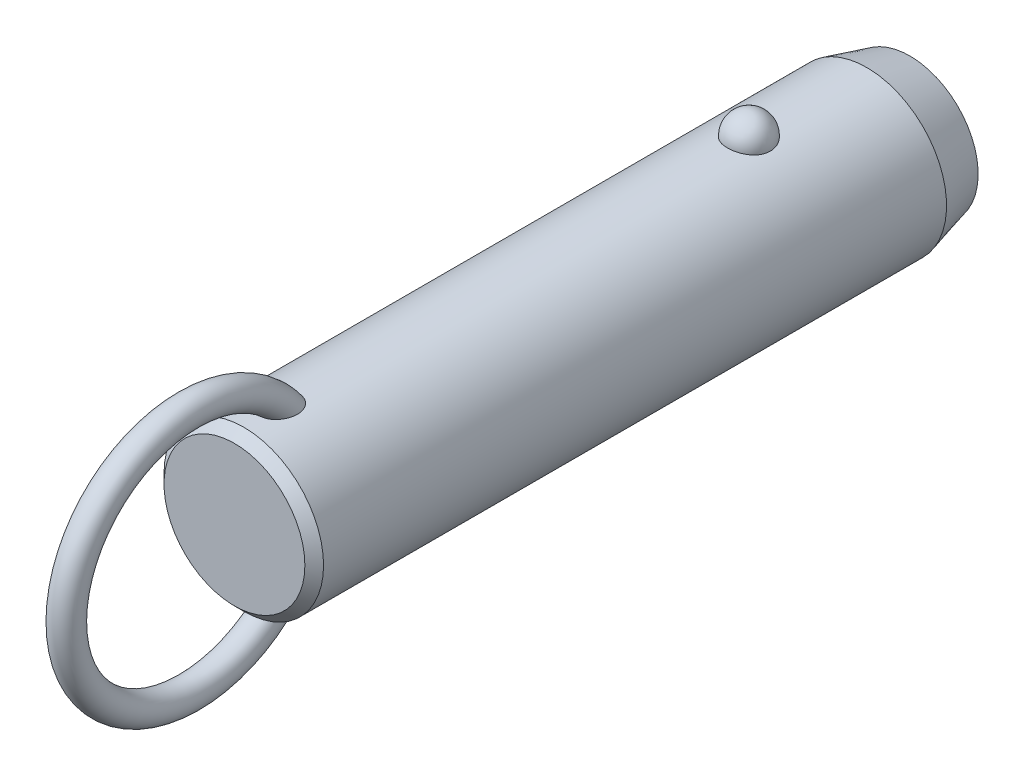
ISO-10303-21;
HEADER;
FILE_DESCRIPTION(('STEP AP214'),'2;1');
FILE_NAME('part.step','',(''),(''),'','','');
FILE_SCHEMA(('AUTOMOTIVE_DESIGN { 1 0 10303 214 1 1 1 1 }'));
ENDSEC;
DATA;
#1=APPLICATION_CONTEXT('core data for automotive mechanical design processes');
#2=APPLICATION_PROTOCOL_DEFINITION('international standard','automotive_design',2000,#1);
#3=PRODUCT_CONTEXT('',#1,'mechanical');
#4=PRODUCT('Part','Part','',(#3));
#5=PRODUCT_RELATED_PRODUCT_CATEGORY('part','',(#4));
#6=PRODUCT_DEFINITION_FORMATION('','',#4);
#7=PRODUCT_DEFINITION_CONTEXT('part definition',#1,'design');
#8=PRODUCT_DEFINITION('design','',#6,#7);
#9=PRODUCT_DEFINITION_SHAPE('','',#8);
#10=(LENGTH_UNIT() NAMED_UNIT(*) SI_UNIT(.MILLI.,.METRE.));
#11=(NAMED_UNIT(*) PLANE_ANGLE_UNIT() SI_UNIT($,.RADIAN.));
#12=(NAMED_UNIT(*) SI_UNIT($,.STERADIAN.) SOLID_ANGLE_UNIT());
#13=UNCERTAINTY_MEASURE_WITH_UNIT(LENGTH_MEASURE(1.E-05),#10,'distance_accuracy_value','');
#14=(GEOMETRIC_REPRESENTATION_CONTEXT(3) GLOBAL_UNCERTAINTY_ASSIGNED_CONTEXT((#13)) GLOBAL_UNIT_ASSIGNED_CONTEXT((#10,
#11,#12)) REPRESENTATION_CONTEXT('',''));
#15=CARTESIAN_POINT('',(0.,0.,0.));
#16=DIRECTION('',(0.,0.,1.));
#17=DIRECTION('',(1.,0.,0.));
#18=AXIS2_PLACEMENT_3D('',#15,#16,#17);
#19=CARTESIAN_POINT('',(0.,0.,55.9));
#20=DIRECTION('',(0.,0.,-1.));
#21=DIRECTION('',(-1.,0.,0.));
#22=AXIS2_PLACEMENT_3D('',#19,#20,#21);
#23=CYLINDRICAL_SURFACE('',#22,11.1);
#24=CARTESIAN_POINT('',(2.9724815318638,10.6945945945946,-3.));
#25=CARTESIAN_POINT('',(2.97247830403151,10.6945972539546,-2.83225059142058));
#26=CARTESIAN_POINT('',(2.95876598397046,10.6984356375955,-2.66445972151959));
#27=CARTESIAN_POINT('',(2.90424529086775,10.7133624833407,-2.33362381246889));
#28=CARTESIAN_POINT('',(2.8634252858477,10.7244540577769,-2.1705808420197));
#29=CARTESIAN_POINT('',(2.75573657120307,10.7526272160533,-1.85396767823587));
#30=CARTESIAN_POINT('',(2.68887937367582,10.7697061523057,-1.70039333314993));
#31=CARTESIAN_POINT('',(2.53079696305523,10.8079438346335,-1.40691598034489));
#32=CARTESIAN_POINT('',(2.43957264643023,10.8291024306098,-1.2670124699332));
#33=CARTESIAN_POINT('',(2.23458150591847,10.8732541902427,-1.00409565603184));
#34=CARTESIAN_POINT('',(2.12071295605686,10.8962553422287,-0.881162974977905));
#35=CARTESIAN_POINT('',(1.87365402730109,10.9414421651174,-0.656352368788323));
#36=CARTESIAN_POINT('',(1.74046358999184,10.9636278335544,-0.554474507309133));
#37=CARTESIAN_POINT('',(1.45872188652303,11.0046495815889,-0.374872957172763));
#38=CARTESIAN_POINT('',(1.31021276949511,11.0234944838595,-0.297085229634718));
#39=CARTESIAN_POINT('',(1.00170030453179,11.0557957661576,-0.167529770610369));
#40=CARTESIAN_POINT('',(0.841698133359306,11.0692526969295,-0.115759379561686));
#41=CARTESIAN_POINT('',(0.517607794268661,11.0890932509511,-0.0403925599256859));
#42=CARTESIAN_POINT('',(0.353633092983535,11.0955916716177,-0.0163383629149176));
#43=CARTESIAN_POINT('',(0.0238420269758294,11.1011989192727,0.0044517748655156));
#44=CARTESIAN_POINT('',(-0.141974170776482,11.1003084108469,0.00119017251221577));
#45=CARTESIAN_POINT('',(-0.468405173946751,11.0912990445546,-0.0323233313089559));
#46=CARTESIAN_POINT('',(-0.629059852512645,11.0832767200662,-0.0622147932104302));
#47=CARTESIAN_POINT('',(-0.942937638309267,11.0609962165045,-0.147645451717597));
#48=CARTESIAN_POINT('',(-1.09616062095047,11.0467379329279,-0.203185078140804));
#49=CARTESIAN_POINT('',(-1.39181061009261,11.0134071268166,-0.3387529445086));
#50=CARTESIAN_POINT('',(-1.53417383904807,10.9943086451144,-0.418913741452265));
#51=CARTESIAN_POINT('',(-1.80342160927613,10.9533667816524,-0.60144882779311));
#52=CARTESIAN_POINT('',(-1.9303046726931,10.9315231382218,-0.703825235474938));
#53=CARTESIAN_POINT('',(-2.16747598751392,10.887005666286,-0.930091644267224));
#54=CARTESIAN_POINT('',(-2.27742774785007,10.8643239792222,-1.05433291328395));
#55=CARTESIAN_POINT('',(-2.47517316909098,10.8209886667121,-1.31966633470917));
#56=CARTESIAN_POINT('',(-2.56296538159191,10.8003351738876,-1.46075958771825));
#57=CARTESIAN_POINT('',(-2.71500300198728,10.7631304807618,-1.75753646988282));
#58=CARTESIAN_POINT('',(-2.77898901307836,10.7466250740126,-1.91335887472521));
#59=CARTESIAN_POINT('',(-2.88046189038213,10.7198747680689,-2.2339152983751));
#60=CARTESIAN_POINT('',(-2.91794947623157,10.709629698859,-2.39864907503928));
#61=CARTESIAN_POINT('',(-2.96537819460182,10.6965949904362,-2.73165170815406));
#62=CARTESIAN_POINT('',(-2.97542891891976,10.693775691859,-2.89990378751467));
#63=CARTESIAN_POINT('',(-2.96804271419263,10.6958279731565,-3.235752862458));
#64=CARTESIAN_POINT('',(-2.95060646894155,10.7006993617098,-3.40334987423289));
#65=CARTESIAN_POINT('',(-2.88883358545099,10.71753912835,-3.73233906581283));
#66=CARTESIAN_POINT('',(-2.84462026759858,10.7294749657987,-3.89375610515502));
#67=CARTESIAN_POINT('',(-2.73050447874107,10.7590797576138,-4.20667949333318));
#68=CARTESIAN_POINT('',(-2.66060103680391,10.7767489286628,-4.35818546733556));
#69=CARTESIAN_POINT('',(-2.49642559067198,10.8159599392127,-4.6478542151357));
#70=CARTESIAN_POINT('',(-2.40203047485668,10.8375211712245,-4.78594458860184));
#71=CARTESIAN_POINT('',(-2.19143488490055,10.8820570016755,-5.0441038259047));
#72=CARTESIAN_POINT('',(-2.07523364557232,10.9050316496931,-5.16417205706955));
#73=CARTESIAN_POINT('',(-1.82361254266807,10.9499219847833,-5.38334833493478));
#74=CARTESIAN_POINT('',(-1.68812945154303,10.9718338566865,-5.48238464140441));
#75=CARTESIAN_POINT('',(-1.40191298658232,11.0120611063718,-5.65618873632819));
#76=CARTESIAN_POINT('',(-1.25118062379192,11.0303767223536,-5.73095813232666));
#77=CARTESIAN_POINT('',(-0.940570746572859,11.0611653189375,-5.85334725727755));
#78=CARTESIAN_POINT('',(-0.780821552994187,11.0737044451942,-5.90127578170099));
#79=CARTESIAN_POINT('',(-0.455204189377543,11.0918598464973,-5.96992976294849));
#80=CARTESIAN_POINT('',(-0.289336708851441,11.0974768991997,-5.99065827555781));
#81=CARTESIAN_POINT('',(0.0406846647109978,11.1011307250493,-6.00418773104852));
#82=CARTESIAN_POINT('',(0.204817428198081,11.099299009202,-5.99747318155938));
#83=CARTESIAN_POINT('',(0.5295530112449,11.088551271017,-5.9574031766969));
#84=CARTESIAN_POINT('',(0.69015594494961,11.0796354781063,-5.92404858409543));
#85=CARTESIAN_POINT('',(1.0027760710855,11.0557204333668,-5.83180084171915));
#86=CARTESIAN_POINT('',(1.15482001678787,11.0407414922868,-5.77299291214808));
#87=CARTESIAN_POINT('',(1.44678373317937,11.0062913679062,-5.63147366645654));
#88=CARTESIAN_POINT('',(1.58670279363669,10.9868199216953,-5.54876095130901));
#89=CARTESIAN_POINT('',(1.8527023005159,10.9451315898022,-5.36027644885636));
#90=CARTESIAN_POINT('',(1.97855158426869,10.9228788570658,-5.25418644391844));
#91=CARTESIAN_POINT('',(2.21080872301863,10.8782509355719,-5.02251354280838));
#92=CARTESIAN_POINT('',(2.31721312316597,10.8558757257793,-4.89692718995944));
#93=CARTESIAN_POINT('',(2.5094551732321,10.8130715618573,-4.62745408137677));
#94=CARTESIAN_POINT('',(2.59493284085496,10.7926798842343,-4.48330448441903));
#95=CARTESIAN_POINT('',(2.740862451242,10.7565495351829,-4.18236358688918));
#96=CARTESIAN_POINT('',(2.80132490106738,10.7408089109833,-4.02557762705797));
#97=CARTESIAN_POINT('',(2.88959070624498,10.7173718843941,-3.72475308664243));
#98=CARTESIAN_POINT('',(2.92062102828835,10.7088950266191,-3.58171216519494));
#99=CARTESIAN_POINT('',(2.96206765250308,10.6975052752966,-3.29245795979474));
#100=CARTESIAN_POINT('',(2.97248434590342,10.6945922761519,-3.14624473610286));
#101=CARTESIAN_POINT('',(2.9724815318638,10.6945945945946,-3.));
#102=B_SPLINE_CURVE_WITH_KNOTS('',3,(#24,#25,#26,#27,#28,#29,#30,#31,#32,#33,#34,#35,#36,#37,
#38,#39,#40,#41,#42,#43,#44,#45,#46,#47,#48,#49,#50,#51,#52,#53,#54,#55,#56,#57,#58,#59,#60,#61,
#62,#63,#64,#65,#66,#67,#68,#69,#70,#71,#72,#73,#74,#75,#76,#77,#78,#79,#80,#81,#82,#83,#84,#85,
#86,#87,#88,#89,#90,#91,#92,#93,#94,#95,#96,#97,#98,#99,#100,#101),.UNSPECIFIED.,.T.,.F.,(4,2,2,
2,2,2,2,2,2,2,2,2,2,2,2,2,2,2,2,2,2,2,2,2,2,2,2,2,2,2,2,2,2,2,2,2,2,2,4),(0.,0.502722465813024,
1.00566079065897,1.5083769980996,2.01107471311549,2.51608392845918,3.02109467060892,
3.52475118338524,4.02835620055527,4.523518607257,5.0186364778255,5.50715297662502,
5.9956776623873,6.48688002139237,6.97812923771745,7.47814366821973,7.9781907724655,
8.48353712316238,8.9888697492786,9.49218093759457,9.99547960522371,10.4964777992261,
10.997494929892,11.5010810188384,12.0046847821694,12.5099796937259,13.0152411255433,
13.5145635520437,14.0138298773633,14.5043200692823,14.9947943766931,15.4836390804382,
15.9725123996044,16.4685040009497,16.9645836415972,17.4686765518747,17.972557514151,
18.410841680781,18.849117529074),.UNSPECIFIED.);
#103=CARTESIAN_POINT('',(2.9724815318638,10.6945945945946,-3.));
#104=VERTEX_POINT('',#103);
#105=EDGE_CURVE('E41',#104,#104,#102,.T.);
#106=ORIENTED_EDGE('',*,*,#105,.T.);
#107=EDGE_LOOP('',(#106));
#108=FACE_BOUND('',#107,.T.);
#109=CARTESIAN_POINT('',(0.,0.,67.3));
#110=DIRECTION('',(0.,0.,1.));
#111=DIRECTION('',(1.,0.,0.));
#112=AXIS2_PLACEMENT_3D('',#109,#110,#111);
#113=CIRCLE('',#112,11.1);
#114=CARTESIAN_POINT('',(11.1,0.,67.3));
#115=VERTEX_POINT('',#114);
#116=EDGE_CURVE('E10',#115,#115,#113,.F.);
#117=ORIENTED_EDGE('',*,*,#116,.T.);
#118=EDGE_LOOP('',(#117));
#119=FACE_BOUND('',#118,.T.);
#120=CARTESIAN_POINT('',(-0.56452033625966,-11.0856356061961,59.557815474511));
#121=CARTESIAN_POINT('',(-0.66720283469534,-11.0804062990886,59.5912839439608));
#122=CARTESIAN_POINT('',(-0.766875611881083,-11.0738877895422,59.6338357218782));
#123=CARTESIAN_POINT('',(-0.957284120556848,-11.0590576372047,59.7354190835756));
#124=CARTESIAN_POINT('',(-1.04801616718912,-11.0507452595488,59.7944574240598));
#125=CARTESIAN_POINT('',(-1.21800952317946,-11.0333016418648,59.9265293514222));
#126=CARTESIAN_POINT('',(-1.29730805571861,-11.0241732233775,59.9995156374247));
#127=CARTESIAN_POINT('',(-1.44337665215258,-11.0060026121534,60.1570374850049));
#128=CARTESIAN_POINT('',(-1.51014622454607,-10.9969604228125,60.2415734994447));
#129=CARTESIAN_POINT('',(-1.63454620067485,-10.9791841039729,60.4255213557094));
#130=CARTESIAN_POINT('',(-1.69127003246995,-10.9705107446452,60.5255493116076));
#131=CARTESIAN_POINT('',(-1.78980785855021,-10.9548648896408,60.7327902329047));
#132=CARTESIAN_POINT('',(-1.83161214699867,-10.9478935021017,60.8400078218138));
#133=CARTESIAN_POINT('',(-1.91557028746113,-10.9335803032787,61.1054080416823));
#134=CARTESIAN_POINT('',(-1.95040620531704,-10.9273269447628,61.2659806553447));
#135=CARTESIAN_POINT('',(-1.99388326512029,-10.9194709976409,61.5906977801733));
#136=CARTESIAN_POINT('',(-2.00248051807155,-10.9178762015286,61.7548478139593));
#137=CARTESIAN_POINT('',(-1.99551615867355,-10.9191578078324,62.1246504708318));
#138=CARTESIAN_POINT('',(-1.9732206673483,-10.9232807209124,62.3301911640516));
#139=CARTESIAN_POINT('',(-1.9152976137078,-10.9335244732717,62.633595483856));
#140=CARTESIAN_POINT('',(-1.89184575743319,-10.9376266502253,62.7340883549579));
#141=CARTESIAN_POINT('',(-1.83700674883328,-10.9469720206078,62.932855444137));
#142=CARTESIAN_POINT('',(-1.80562070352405,-10.9522150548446,63.0311299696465));
#143=CARTESIAN_POINT('',(-1.73463055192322,-10.9636837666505,63.2259148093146));
#144=CARTESIAN_POINT('',(-1.69493416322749,-10.9699202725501,63.3223907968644));
#145=CARTESIAN_POINT('',(-1.60745141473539,-10.9830806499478,63.5116262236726));
#146=CARTESIAN_POINT('',(-1.55966150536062,-10.9900048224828,63.6043840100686));
#147=CARTESIAN_POINT('',(-1.45591812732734,-11.0042280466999,63.7846907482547));
#148=CARTESIAN_POINT('',(-1.40000013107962,-11.0115253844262,63.8722601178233));
#149=CARTESIAN_POINT('',(-1.27937470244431,-11.0261911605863,64.0410298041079));
#150=CARTESIAN_POINT('',(-1.21467835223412,-11.0335594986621,64.1222379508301));
#151=CARTESIAN_POINT('',(-1.08218150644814,-11.0473027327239,64.2690010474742));
#152=CARTESIAN_POINT('',(-1.01522633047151,-11.0537063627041,64.335309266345));
#153=CARTESIAN_POINT('',(-0.872952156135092,-11.065850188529,64.4583780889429));
#154=CARTESIAN_POINT('',(-0.797642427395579,-11.0715911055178,64.5151491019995));
#155=CARTESIAN_POINT('',(-0.651396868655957,-11.081071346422,64.6075155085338));
#156=CARTESIAN_POINT('',(-0.581712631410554,-11.0849841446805,64.6450491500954));
#157=CARTESIAN_POINT('',(-0.437066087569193,-11.0916271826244,64.7082594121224));
#158=CARTESIAN_POINT('',(-0.362109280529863,-11.0943586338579,64.7339481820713));
#159=CARTESIAN_POINT('',(-0.207828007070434,-11.0983242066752,64.771117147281));
#160=CARTESIAN_POINT('',(-0.128467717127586,-11.0995432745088,64.7824545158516));
#161=CARTESIAN_POINT('',(0.030910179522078,-11.1002423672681,64.7889658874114));
#162=CARTESIAN_POINT('',(0.110927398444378,-11.0997233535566,64.7841488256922));
#163=CARTESIAN_POINT('',(0.256406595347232,-11.097240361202,64.7609599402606));
#164=CARTESIAN_POINT('',(0.322235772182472,-11.0955074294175,64.7447543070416));
#165=CARTESIAN_POINT('',(0.450635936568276,-11.0910350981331,64.7026008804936));
#166=CARTESIAN_POINT('',(0.513205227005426,-11.0882951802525,64.6766480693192));
#167=CARTESIAN_POINT('',(0.662626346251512,-11.0805620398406,64.6026073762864));
#168=CARTESIAN_POINT('',(0.747127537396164,-11.0751144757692,64.5498452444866));
#169=CARTESIAN_POINT('',(0.906756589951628,-11.0631932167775,64.4317206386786));
#170=CARTESIAN_POINT('',(0.981859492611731,-11.0567168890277,64.3663257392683));
#171=CARTESIAN_POINT('',(1.10712207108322,-11.0447856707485,64.2422633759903));
#172=CARTESIAN_POINT('',(1.15909566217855,-11.0394280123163,64.1853831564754));
#173=CARTESIAN_POINT('',(1.25791923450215,-11.0286040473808,64.0673271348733));
#174=CARTESIAN_POINT('',(1.30476642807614,-11.0231376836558,64.006149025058));
#175=CARTESIAN_POINT('',(1.4381861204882,-11.0068027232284,63.8173051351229));
#176=CARTESIAN_POINT('',(1.51751767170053,-10.9960104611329,63.6844531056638));
#177=CARTESIAN_POINT('',(1.6359754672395,-10.9788847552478,63.4531371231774));
#178=CARTESIAN_POINT('',(1.67988876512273,-10.9722190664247,63.3570530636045));
#179=CARTESIAN_POINT('',(1.75953241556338,-10.9597298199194,63.1614311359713));
#180=CARTESIAN_POINT('',(1.79525967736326,-10.9539065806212,63.0618919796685));
#181=CARTESIAN_POINT('',(1.85844731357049,-10.9433632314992,62.8602111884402));
#182=CARTESIAN_POINT('',(1.88591073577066,-10.9386427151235,62.7580705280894));
#183=CARTESIAN_POINT('',(1.93234324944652,-10.9305350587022,62.551819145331));
#184=CARTESIAN_POINT('',(1.95131065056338,-10.9271481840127,62.4477080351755));
#185=CARTESIAN_POINT('',(1.99040203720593,-10.9201183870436,62.165458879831));
#186=CARTESIAN_POINT('',(2.00221217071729,-10.9179256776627,61.9860370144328));
#187=CARTESIAN_POINT('',(1.99711676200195,-10.9188636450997,61.6277133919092));
#188=CARTESIAN_POINT('',(1.98026150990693,-10.9219849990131,61.4488112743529));
#189=CARTESIAN_POINT('',(1.92151657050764,-10.9324473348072,61.1364514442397));
#190=CARTESIAN_POINT('',(1.88605081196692,-10.9386915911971,61.0017594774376));
#191=CARTESIAN_POINT('',(1.79393020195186,-10.9541780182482,60.739966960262));
#192=CARTESIAN_POINT('',(1.73729868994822,-10.9634168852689,60.6128582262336));
#193=CARTESIAN_POINT('',(1.61237037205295,-10.9824218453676,60.3894184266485));
#194=CARTESIAN_POINT('',(1.54715374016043,-10.9918945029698,60.2913455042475));
#195=CARTESIAN_POINT('',(1.40127026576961,-11.0114415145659,60.1074341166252));
#196=CARTESIAN_POINT('',(1.32060742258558,-11.0215157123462,60.0215924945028));
#197=CARTESIAN_POINT('',(1.14474787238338,-11.041168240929,59.8651630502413));
#198=CARTESIAN_POINT('',(1.04947805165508,-11.0507437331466,59.7946565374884));
#199=CARTESIAN_POINT('',(0.847278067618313,-11.0680789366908,59.672640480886));
#200=CARTESIAN_POINT('',(0.740351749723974,-11.0758392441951,59.6211246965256));
#201=CARTESIAN_POINT('',(0.529289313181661,-11.0878275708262,59.5434852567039));
#202=CARTESIAN_POINT('',(0.425895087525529,-11.0923259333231,59.515377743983));
#203=CARTESIAN_POINT('',(0.215723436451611,-11.0984001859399,59.4777038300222));
#204=CARTESIAN_POINT('',(0.10894793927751,-11.0999777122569,59.4681270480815));
#205=CARTESIAN_POINT('',(-0.0938962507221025,-11.1000196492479,59.4678773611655));
#206=CARTESIAN_POINT('',(-0.189967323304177,-11.0987797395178,59.4754089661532));
#207=CARTESIAN_POINT('',(-0.379657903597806,-11.0939111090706,59.5055079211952));
#208=CARTESIAN_POINT('',(-0.473277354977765,-11.0902823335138,59.5280756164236));
#209=CARTESIAN_POINT('',(-0.56452033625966,-11.0856356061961,59.557815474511));
#210=B_SPLINE_CURVE_WITH_KNOTS('',3,(#120,#121,#122,#123,#124,#125,#126,#127,#128,#129,#130,
#131,#132,#133,#134,#135,#136,#137,#138,#139,#140,#141,#142,#143,#144,#145,#146,#147,#148,#149,
#150,#151,#152,#153,#154,#155,#156,#157,#158,#159,#160,#161,#162,#163,#164,#165,#166,#167,#168,
#169,#170,#171,#172,#173,#174,#175,#176,#177,#178,#179,#180,#181,#182,#183,#184,#185,#186,#187,
#188,#189,#190,#191,#192,#193,#194,#195,#196,#197,#198,#199,#200,#201,#202,#203,#204,#205,#206,
#207,#208,#209),.UNSPECIFIED.,.T.,.F.,(4,2,2,2,2,2,2,2,2,2,2,2,2,2,2,2,2,2,2,2,2,2,2,2,2,2,2,2,
2,2,2,2,2,2,2,2,2,2,2,2,2,2,2,2,4),(0.,0.323999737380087,0.648132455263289,0.971184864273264,
1.29424994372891,1.63886237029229,1.98369857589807,2.47426059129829,2.96564271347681,
3.58257396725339,3.89215258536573,4.201688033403,4.51486273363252,4.82817514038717,
5.1401591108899,5.45175282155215,5.73442856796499,6.01679375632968,6.25364580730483,
6.49025437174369,6.72919963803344,6.96801276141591,7.17061258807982,7.3733168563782,
7.67094989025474,7.9693572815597,8.20075067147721,8.43226927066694,8.89581623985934,
9.21306533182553,9.53043400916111,9.847685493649,10.1650000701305,10.7022930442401,
11.2386443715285,11.6553390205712,12.0715755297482,12.4245637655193,12.7774607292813,
13.1321855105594,13.4867936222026,13.8068771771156,14.1267813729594,14.4146787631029,
14.7025827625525),.UNSPECIFIED.);
#211=CARTESIAN_POINT('',(-0.56452033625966,-11.0856356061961,59.557815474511));
#212=VERTEX_POINT('',#211);
#213=EDGE_CURVE('E60',#212,#212,#210,.T.);
#214=ORIENTED_EDGE('',*,*,#213,.T.);
#215=EDGE_LOOP('',(#214));
#216=FACE_BOUND('',#215,.T.);
#217=CARTESIAN_POINT('',(-0.56452033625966,11.0856356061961,59.557815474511));
#218=CARTESIAN_POINT('',(-0.46854206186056,11.0905203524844,59.5265456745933));
#219=CARTESIAN_POINT('',(-0.369793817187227,11.0942886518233,59.5031576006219));
#220=CARTESIAN_POINT('',(-0.169555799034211,11.0991586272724,59.4730858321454));
#221=CARTESIAN_POINT('',(-0.0680604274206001,11.1002543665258,59.4664393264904));
#222=CARTESIAN_POINT('',(0.134549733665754,11.099646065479,59.4701579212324));
#223=CARTESIAN_POINT('',(0.235664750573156,11.0979441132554,59.4805103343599));
#224=CARTESIAN_POINT('',(0.434632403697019,11.0919342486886,59.5178318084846));
#225=CARTESIAN_POINT('',(0.53248665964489,11.0876276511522,59.5447924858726));
#226=CARTESIAN_POINT('',(0.72244585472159,11.0768742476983,59.6144096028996));
#227=CARTESIAN_POINT('',(0.814543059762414,11.0704246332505,59.6570866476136));
#228=CARTESIAN_POINT('',(0.990565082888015,11.0560659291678,59.7566487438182));
#229=CARTESIAN_POINT('',(1.07448844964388,11.048156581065,59.8135363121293));
#230=CARTESIAN_POINT('',(1.23562672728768,11.0313221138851,59.9422106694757));
#231=CARTESIAN_POINT('',(1.31242684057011,11.0223686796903,60.0145117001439));
#232=CARTESIAN_POINT('',(1.45398030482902,11.0045918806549,60.1700425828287));
#233=CARTESIAN_POINT('',(1.51873073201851,10.9957685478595,60.2532750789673));
#234=CARTESIAN_POINT('',(1.64107232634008,10.9782087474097,60.4363842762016));
#235=CARTESIAN_POINT('',(1.6974317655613,10.9695572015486,60.5370893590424));
#236=CARTESIAN_POINT('',(1.79515063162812,10.9539887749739,60.7456264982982));
#237=CARTESIAN_POINT('',(1.83649966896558,10.9470730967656,60.8534634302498));
#238=CARTESIAN_POINT('',(1.91931148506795,10.9329211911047,61.1203995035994));
#239=CARTESIAN_POINT('',(1.95340104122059,10.9267904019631,61.2818612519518));
#240=CARTESIAN_POINT('',(1.99526195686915,10.9192174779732,61.6082163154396));
#241=CARTESIAN_POINT('',(2.00298989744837,10.9177830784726,61.7731148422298));
#242=CARTESIAN_POINT('',(1.99396251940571,10.9194420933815,62.1441006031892));
#243=CARTESIAN_POINT('',(1.97050829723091,10.923774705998,62.3500387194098));
#244=CARTESIAN_POINT('',(1.91079643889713,10.9343131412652,62.6539019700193));
#245=CARTESIAN_POINT('',(1.8867370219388,10.9385106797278,62.7545296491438));
#246=CARTESIAN_POINT('',(1.83065508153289,10.9480376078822,62.9535107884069));
#247=CARTESIAN_POINT('',(1.79863369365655,10.9533668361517,63.0518645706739));
#248=CARTESIAN_POINT('',(1.72633365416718,10.9649954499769,63.2467203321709));
#249=CARTESIAN_POINT('',(1.68596409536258,10.9713053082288,63.3431879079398));
#250=CARTESIAN_POINT('',(1.59707998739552,10.9845964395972,63.5323233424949));
#251=CARTESIAN_POINT('',(1.54856169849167,10.9915780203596,63.6249894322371));
#252=CARTESIAN_POINT('',(1.44330168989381,11.0058935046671,63.8049752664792));
#253=CARTESIAN_POINT('',(1.38659749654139,11.0132257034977,63.892316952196));
#254=CARTESIAN_POINT('',(1.26431158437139,11.0279330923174,64.0604563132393));
#255=CARTESIAN_POINT('',(1.19874160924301,11.0353082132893,64.1412624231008));
#256=CARTESIAN_POINT('',(1.06542088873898,11.048931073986,64.2859856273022));
#257=CARTESIAN_POINT('',(0.998640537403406,11.0552153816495,64.350784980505));
#258=CARTESIAN_POINT('',(0.856896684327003,11.0671032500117,64.4708462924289));
#259=CARTESIAN_POINT('',(0.781942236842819,11.0727075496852,64.5261186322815));
#260=CARTESIAN_POINT('',(0.636276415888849,11.081949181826,64.6159721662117));
#261=CARTESIAN_POINT('',(0.566755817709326,11.0857572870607,64.6524410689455));
#262=CARTESIAN_POINT('',(0.422602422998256,11.0921860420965,64.7135333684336));
#263=CARTESIAN_POINT('',(0.347974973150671,11.0948079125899,64.7381689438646));
#264=CARTESIAN_POINT('',(0.194593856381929,11.0985608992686,64.7733233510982));
#265=CARTESIAN_POINT('',(0.115807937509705,11.0996777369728,64.7837069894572));
#266=CARTESIAN_POINT('',(-0.0422499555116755,11.1002003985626,64.7885747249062));
#267=CARTESIAN_POINT('',(-0.121521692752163,11.09960699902,64.783066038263));
#268=CARTESIAN_POINT('',(-0.266046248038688,11.0970123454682,64.7588271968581));
#269=CARTESIAN_POINT('',(-0.331661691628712,11.0952283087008,64.7421356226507));
#270=CARTESIAN_POINT('',(-0.45958809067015,11.0906663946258,64.6991117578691));
#271=CARTESIAN_POINT('',(-0.521897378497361,11.0878880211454,64.672774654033));
#272=CARTESIAN_POINT('',(-0.6714464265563,11.0800342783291,64.5975130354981));
#273=CARTESIAN_POINT('',(-0.756250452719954,11.0744969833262,64.5438182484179));
#274=CARTESIAN_POINT('',(-0.916349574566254,11.0624045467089,64.4238029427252));
#275=CARTESIAN_POINT('',(-0.991618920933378,11.0558467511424,64.3574493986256));
#276=CARTESIAN_POINT('',(-1.11713140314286,11.0437783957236,64.2316335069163));
#277=CARTESIAN_POINT('',(-1.16920539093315,11.0383619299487,64.1739524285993));
#278=CARTESIAN_POINT('',(-1.26817476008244,11.02743010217,64.0542809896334));
#279=CARTESIAN_POINT('',(-1.31506731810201,11.0219146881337,63.9922883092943));
#280=CARTESIAN_POINT('',(-1.40399813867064,11.0109399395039,63.8647843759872));
#281=CARTESIAN_POINT('',(-1.44602864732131,11.0054807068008,63.7992677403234));
#282=CARTESIAN_POINT('',(-1.52538779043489,10.9947621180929,63.6654223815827));
#283=CARTESIAN_POINT('',(-1.56271516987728,10.9895028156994,63.5970929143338));
#284=CARTESIAN_POINT('',(-1.64537943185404,10.9774790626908,63.4332101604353));
#285=CARTESIAN_POINT('',(-1.68879497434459,10.9708503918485,63.3366735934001));
#286=CARTESIAN_POINT('',(-1.76740738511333,10.9584602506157,63.1402369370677));
#287=CARTESIAN_POINT('',(-1.80260120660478,10.95269910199,63.0403356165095));
#288=CARTESIAN_POINT('',(-1.86468657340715,10.9423003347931,62.8379663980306));
#289=CARTESIAN_POINT('',(-1.89158164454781,10.9376622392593,62.7354996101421));
#290=CARTESIAN_POINT('',(-1.93682458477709,10.9297405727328,62.5286429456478));
#291=CARTESIAN_POINT('',(-1.9551708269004,10.9264572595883,62.424252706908));
#292=CARTESIAN_POINT('',(-1.99232562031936,10.9197647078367,62.1426287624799));
#293=CARTESIAN_POINT('',(-2.00294603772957,10.9177914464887,61.9641857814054));
#294=CARTESIAN_POINT('',(-1.99566675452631,10.9191290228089,61.6079962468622));
#295=CARTESIAN_POINT('',(-1.97781651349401,10.9224306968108,61.4302490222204));
#296=CARTESIAN_POINT('',(-1.91747214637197,10.93315926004,61.1197921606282));
#297=CARTESIAN_POINT('',(-1.88131022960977,10.9395108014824,60.9858251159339));
#298=CARTESIAN_POINT('',(-1.7879038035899,10.9551659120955,60.7255975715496));
#299=CARTESIAN_POINT('',(-1.7306830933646,10.9644661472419,60.5993285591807));
#300=CARTESIAN_POINT('',(-1.60475573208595,10.9835398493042,60.3774156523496));
#301=CARTESIAN_POINT('',(-1.53908879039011,10.9930297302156,60.2800265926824));
#302=CARTESIAN_POINT('',(-1.39238608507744,11.0125708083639,60.0975250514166));
#303=CARTESIAN_POINT('',(-1.31135150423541,11.0226219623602,60.0124116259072));
#304=CARTESIAN_POINT('',(-1.14382035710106,11.0411991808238,59.8652994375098));
#305=CARTESIAN_POINT('',(-1.05858500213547,11.0497792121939,59.8018693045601));
#306=CARTESIAN_POINT('',(-0.878723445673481,11.0655285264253,59.6902505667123));
#307=CARTESIAN_POINT('',(-0.784123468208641,11.0727015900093,59.6420208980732));
#308=CARTESIAN_POINT('',(-0.646163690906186,11.0812501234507,59.586023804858));
#309=CARTESIAN_POINT('',(-0.605595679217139,11.0835451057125,59.5711978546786));
#310=CARTESIAN_POINT('',(-0.56452033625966,11.0856356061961,59.557815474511));
#311=B_SPLINE_CURVE_WITH_KNOTS('',3,(#217,#218,#219,#220,#221,#222,#223,#224,#225,#226,#227,
#228,#229,#230,#231,#232,#233,#234,#235,#236,#237,#238,#239,#240,#241,#242,#243,#244,#245,#246,
#247,#248,#249,#250,#251,#252,#253,#254,#255,#256,#257,#258,#259,#260,#261,#262,#263,#264,#265,
#266,#267,#268,#269,#270,#271,#272,#273,#274,#275,#276,#277,#278,#279,#280,#281,#282,#283,#284,
#285,#286,#287,#288,#289,#290,#291,#292,#293,#294,#295,#296,#297,#298,#299,#300,#301,#302,#303,
#304,#305,#306,#307,#308,#309,#310),.UNSPECIFIED.,.T.,.F.,(4,2,2,2,2,2,2,2,2,2,2,2,2,2,2,2,2,2,
2,2,2,2,2,2,2,2,2,2,2,2,2,2,2,2,2,2,2,2,2,2,2,2,2,2,2,2,4),(0.,0.303061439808,0.606795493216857,
0.910302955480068,1.21365733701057,1.51741085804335,1.82121821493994,2.13745205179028,
2.45376252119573,2.799586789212,3.14564996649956,3.63832391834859,4.13180893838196,
4.75031912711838,5.06071926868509,5.37107516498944,5.68500772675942,5.99908475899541,
6.31176519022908,6.62403542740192,6.90315673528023,7.18197194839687,7.41687778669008,
7.65154134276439,7.8884158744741,8.12518286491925,8.32752842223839,8.5299750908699,
8.82986421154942,9.13054668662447,9.36393502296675,9.59744991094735,9.83133221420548,
10.0652767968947,10.383032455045,10.7009056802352,11.0186436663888,11.3364420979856,
11.8705925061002,12.4038159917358,12.8189662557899,13.2336487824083,13.5857049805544,
13.9377340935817,14.2561354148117,14.5736690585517,14.7033687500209),.UNSPECIFIED.);
#312=CARTESIAN_POINT('',(-0.56452033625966,11.0856356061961,59.557815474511));
#313=VERTEX_POINT('',#312);
#314=EDGE_CURVE('E68',#313,#313,#311,.T.);
#315=ORIENTED_EDGE('',*,*,#314,.T.);
#316=EDGE_LOOP('',(#315));
#317=FACE_BOUND('',#316,.T.);
#318=CARTESIAN_POINT('',(0.,0.,-19.3999999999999));
#319=DIRECTION('',(0.,0.,-1.));
#320=DIRECTION('',(-1.,0.,0.));
#321=AXIS2_PLACEMENT_3D('',#318,#319,#320);
#322=CIRCLE('',#321,11.1);
#323=CARTESIAN_POINT('',(-11.1,0.,-19.3999999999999));
#324=VERTEX_POINT('',#323);
#325=EDGE_CURVE('E57',#324,#324,#322,.F.);
#326=ORIENTED_EDGE('',*,*,#325,.T.);
#327=EDGE_LOOP('',(#326));
#328=FACE_BOUND('',#327,.T.);
#329=ADVANCED_FACE('F37',(#108,#119,#216,#317,#328),#23,.T.);
#330=CARTESIAN_POINT('',(0.,0.,-25.4));
#331=DIRECTION('',(0.,0.,-1.));
#332=DIRECTION('',(-1.,0.,0.));
#333=AXIS2_PLACEMENT_3D('',#330,#331,#332);
#334=PLANE('',#333);
#335=CARTESIAN_POINT('',(0.,0.,-25.4));
#336=DIRECTION('',(0.,0.,-1.));
#337=DIRECTION('',(-1.,0.,0.));
#338=AXIS2_PLACEMENT_3D('',#335,#336,#337);
#339=CIRCLE('',#338,9.49230484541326);
#340=CARTESIAN_POINT('',(-9.49230484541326,0.,-25.4));
#341=VERTEX_POINT('',#340);
#342=EDGE_CURVE('E67',#341,#341,#339,.T.);
#343=ORIENTED_EDGE('',*,*,#342,.T.);
#344=EDGE_LOOP('',(#343));
#345=FACE_BOUND('',#344,.T.);
#346=ADVANCED_FACE('F86',(#345),#334,.T.);
#347=CARTESIAN_POINT('',(0.,0.,-25.4));
#348=DIRECTION('',(0.,0.,1.));
#349=DIRECTION('',(1.,0.,0.));
#350=AXIS2_PLACEMENT_3D('',#347,#348,#349);
#351=CONICAL_SURFACE('',#350,9.49230484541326,0.261799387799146);
#352=ORIENTED_EDGE('',*,*,#325,.F.);
#353=EDGE_LOOP('',(#352));
#354=FACE_BOUND('',#353,.T.);
#355=ORIENTED_EDGE('',*,*,#342,.F.);
#356=EDGE_LOOP('',(#355));
#357=FACE_BOUND('',#356,.T.);
#358=ADVANCED_FACE('F84',(#354,#357),#351,.T.);
#359=CARTESIAN_POINT('',(0.,0.,68.6));
#360=DIRECTION('',(0.,0.,1.));
#361=DIRECTION('',(1.,0.,0.));
#362=AXIS2_PLACEMENT_3D('',#359,#360,#361);
#363=PLANE('',#362);
#364=CARTESIAN_POINT('',(0.,0.,68.6));
#365=DIRECTION('',(0.,0.,1.));
#366=DIRECTION('',(1.,0.,0.));
#367=AXIS2_PLACEMENT_3D('',#364,#365,#366);
#368=CIRCLE('',#367,9.79999999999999);
#369=CARTESIAN_POINT('',(9.79999999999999,0.,68.6));
#370=VERTEX_POINT('',#369);
#371=EDGE_CURVE('E50',#370,#370,#368,.T.);
#372=ORIENTED_EDGE('',*,*,#371,.T.);
#373=EDGE_LOOP('',(#372));
#374=FACE_BOUND('',#373,.T.);
#375=ADVANCED_FACE('F78',(#374),#363,.T.);
#376=CARTESIAN_POINT('',(0.,0.,74.95));
#377=DIRECTION('',(1.,0.,0.));
#378=DIRECTION('',(0.,0.,-1.));
#379=AXIS2_PLACEMENT_3D('',#376,#377,#378);
#380=TOROIDAL_SURFACE('',#379,17.05,2.);
#381=ORIENTED_EDGE('',*,*,#314,.F.);
#382=EDGE_LOOP('',(#381));
#383=FACE_BOUND('',#382,.T.);
#384=ORIENTED_EDGE('',*,*,#213,.F.);
#385=EDGE_LOOP('',(#384));
#386=FACE_BOUND('',#385,.T.);
#387=ADVANCED_FACE('F74',(#383,#386),#380,.T.);
#388=CARTESIAN_POINT('',(0.,0.,68.6));
#389=DIRECTION('',(0.,0.,-1.));
#390=DIRECTION('',(-1.,0.,0.));
#391=AXIS2_PLACEMENT_3D('',#388,#389,#390);
#392=CONICAL_SURFACE('',#391,9.79999999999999,0.785398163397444);
#393=ORIENTED_EDGE('',*,*,#116,.F.);
#394=EDGE_LOOP('',(#393));
#395=FACE_BOUND('',#394,.T.);
#396=ORIENTED_EDGE('',*,*,#371,.F.);
#397=EDGE_LOOP('',(#396));
#398=FACE_BOUND('',#397,.T.);
#399=ADVANCED_FACE('F39',(#395,#398),#392,.T.);
#400=CARTESIAN_POINT('',(0.,11.1,-3.));
#401=DIRECTION('',(0.,1.,0.));
#402=DIRECTION('',(0.,0.,-1.));
#403=AXIS2_PLACEMENT_3D('',#400,#401,#402);
#404=SPHERICAL_SURFACE('',#403,3.);
#405=ORIENTED_EDGE('',*,*,#105,.F.);
#406=EDGE_LOOP('',(#405));
#407=FACE_BOUND('',#406,.T.);
#408=ADVANCED_FACE('F80',(#407),#404,.T.);
#409=CLOSED_SHELL('',(#329,#346,#358,#375,#387,#399,#408));
#410=MANIFOLD_SOLID_BREP('B2',#409);
#411=ADVANCED_BREP_SHAPE_REPRESENTATION('',(#18,#410),#14);
#412=SHAPE_DEFINITION_REPRESENTATION(#9,#411);
ENDSEC;
END-ISO-10303-21;
